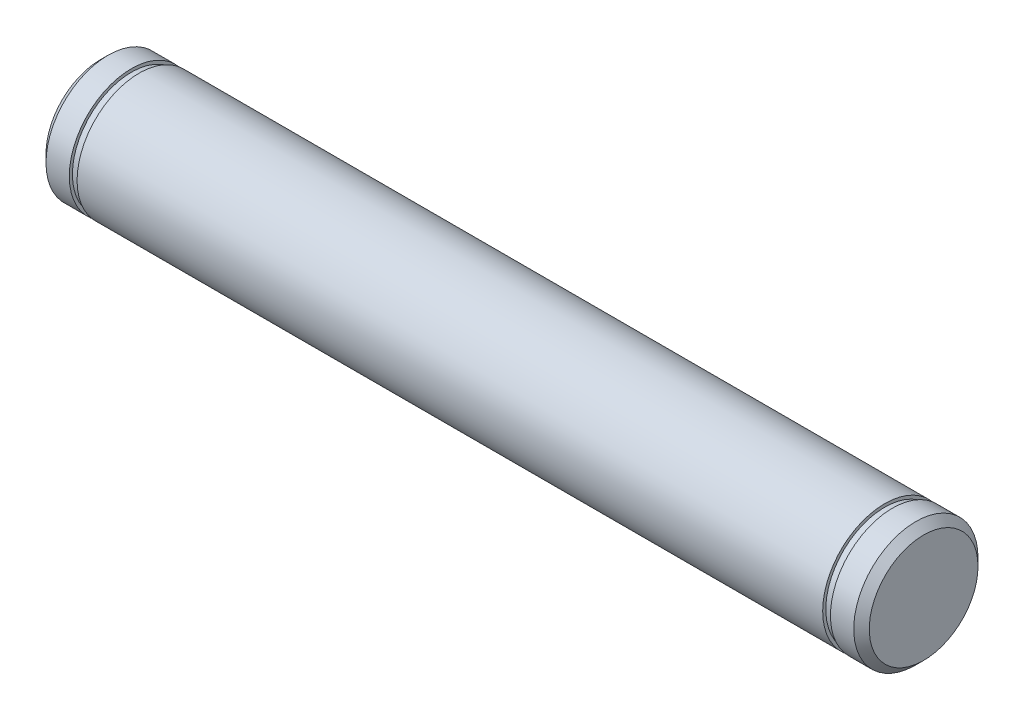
ISO-10303-21;
HEADER;
FILE_DESCRIPTION(('STEP AP214'),'2;1');
FILE_NAME('part.step','',(''),(''),'','','');
FILE_SCHEMA(('AUTOMOTIVE_DESIGN { 1 0 10303 214 1 1 1 1 }'));
ENDSEC;
DATA;
#1=APPLICATION_CONTEXT('core data for automotive mechanical design processes');
#2=APPLICATION_PROTOCOL_DEFINITION('international standard','automotive_design',2000,#1);
#3=PRODUCT_CONTEXT('',#1,'mechanical');
#4=PRODUCT('Part','Part','',(#3));
#5=PRODUCT_RELATED_PRODUCT_CATEGORY('part','',(#4));
#6=PRODUCT_DEFINITION_FORMATION('','',#4);
#7=PRODUCT_DEFINITION_CONTEXT('part definition',#1,'design');
#8=PRODUCT_DEFINITION('design','',#6,#7);
#9=PRODUCT_DEFINITION_SHAPE('','',#8);
#10=(LENGTH_UNIT() NAMED_UNIT(*) SI_UNIT(.MILLI.,.METRE.));
#11=(NAMED_UNIT(*) PLANE_ANGLE_UNIT() SI_UNIT($,.RADIAN.));
#12=(NAMED_UNIT(*) SI_UNIT($,.STERADIAN.) SOLID_ANGLE_UNIT());
#13=UNCERTAINTY_MEASURE_WITH_UNIT(LENGTH_MEASURE(1.E-05),#10,'distance_accuracy_value','');
#14=(GEOMETRIC_REPRESENTATION_CONTEXT(3) GLOBAL_UNCERTAINTY_ASSIGNED_CONTEXT((#13)) GLOBAL_UNIT_ASSIGNED_CONTEXT((#10,
#11,#12)) REPRESENTATION_CONTEXT('',''));
#15=CARTESIAN_POINT('',(0.,0.,0.));
#16=DIRECTION('',(0.,0.,1.));
#17=DIRECTION('',(1.,0.,0.));
#18=AXIS2_PLACEMENT_3D('',#15,#16,#17);
#19=CARTESIAN_POINT('',(26.5,0.,0.));
#20=DIRECTION('',(-1.,0.,0.));
#21=DIRECTION('',(0.,0.,1.));
#22=AXIS2_PLACEMENT_3D('',#19,#20,#21);
#23=CYLINDRICAL_SURFACE('',#22,2.);
#24=CARTESIAN_POINT('',(25.25,0.,0.));
#25=DIRECTION('',(1.,0.,0.));
#26=DIRECTION('',(0.,0.,-1.));
#27=AXIS2_PLACEMENT_3D('',#24,#25,#26);
#28=CIRCLE('',#27,2.);
#29=CARTESIAN_POINT('',(25.25,0.,-2.));
#30=VERTEX_POINT('',#29);
#31=EDGE_CURVE('E54',#30,#30,#28,.T.);
#32=ORIENTED_EDGE('',*,*,#31,.F.);
#33=EDGE_LOOP('',(#32));
#34=FACE_BOUND('',#33,.T.);
#35=CARTESIAN_POINT('',(1.25,0.,0.));
#36=DIRECTION('',(-1.,0.,0.));
#37=DIRECTION('',(0.,0.,1.));
#38=AXIS2_PLACEMENT_3D('',#35,#36,#37);
#39=CIRCLE('',#38,2.);
#40=CARTESIAN_POINT('',(1.25,0.,2.));
#41=VERTEX_POINT('',#40);
#42=EDGE_CURVE('E55',#41,#41,#39,.T.);
#43=ORIENTED_EDGE('',*,*,#42,.F.);
#44=EDGE_LOOP('',(#43));
#45=FACE_BOUND('',#44,.T.);
#46=ADVANCED_FACE('F34',(#34,#45),#23,.T.);
#47=CARTESIAN_POINT('',(25.25,0.,0.));
#48=DIRECTION('',(1.,0.,0.));
#49=DIRECTION('',(0.,0.,-1.));
#50=AXIS2_PLACEMENT_3D('',#47,#48,#49);
#51=PLANE('',#50);
#52=CARTESIAN_POINT('',(25.25,0.,0.));
#53=DIRECTION('',(1.,0.,0.));
#54=DIRECTION('',(0.,0.,-1.));
#55=AXIS2_PLACEMENT_3D('',#52,#53,#54);
#56=CIRCLE('',#55,1.9);
#57=CARTESIAN_POINT('',(25.25,0.,-1.9));
#58=VERTEX_POINT('',#57);
#59=EDGE_CURVE('E68',#58,#58,#56,.T.);
#60=ORIENTED_EDGE('',*,*,#59,.F.);
#61=EDGE_LOOP('',(#60));
#62=FACE_BOUND('',#61,.T.);
#63=ORIENTED_EDGE('',*,*,#31,.T.);
#64=EDGE_LOOP('',(#63));
#65=FACE_BOUND('',#64,.T.);
#66=ADVANCED_FACE('F91',(#62,#65),#51,.T.);
#67=CARTESIAN_POINT('',(25.5,0.,0.));
#68=DIRECTION('',(1.,0.,0.));
#69=DIRECTION('',(0.,0.,-1.));
#70=AXIS2_PLACEMENT_3D('',#67,#68,#69);
#71=PLANE('',#70);
#72=CARTESIAN_POINT('',(25.5,0.,0.));
#73=DIRECTION('',(1.,0.,0.));
#74=DIRECTION('',(0.,0.,-1.));
#75=AXIS2_PLACEMENT_3D('',#72,#73,#74);
#76=CIRCLE('',#75,1.9);
#77=CARTESIAN_POINT('',(25.5,0.,-1.9));
#78=VERTEX_POINT('',#77);
#79=EDGE_CURVE('E58',#78,#78,#76,.T.);
#80=ORIENTED_EDGE('',*,*,#79,.T.);
#81=EDGE_LOOP('',(#80));
#82=FACE_BOUND('',#81,.T.);
#83=CARTESIAN_POINT('',(25.5,0.,0.));
#84=DIRECTION('',(1.,0.,0.));
#85=DIRECTION('',(0.,0.,-1.));
#86=AXIS2_PLACEMENT_3D('',#83,#84,#85);
#87=CIRCLE('',#86,2.);
#88=CARTESIAN_POINT('',(25.5,0.,-2.));
#89=VERTEX_POINT('',#88);
#90=EDGE_CURVE('E65',#89,#89,#87,.T.);
#91=ORIENTED_EDGE('',*,*,#90,.F.);
#92=EDGE_LOOP('',(#91));
#93=FACE_BOUND('',#92,.T.);
#94=ADVANCED_FACE('F98',(#82,#93),#71,.F.);
#95=CARTESIAN_POINT('',(25.25,0.,0.));
#96=DIRECTION('',(1.,0.,0.));
#97=DIRECTION('',(0.,0.,-1.));
#98=AXIS2_PLACEMENT_3D('',#95,#96,#97);
#99=CYLINDRICAL_SURFACE('',#98,1.9);
#100=ORIENTED_EDGE('',*,*,#59,.T.);
#101=EDGE_LOOP('',(#100));
#102=FACE_BOUND('',#101,.T.);
#103=ORIENTED_EDGE('',*,*,#79,.F.);
#104=EDGE_LOOP('',(#103));
#105=FACE_BOUND('',#104,.T.);
#106=ADVANCED_FACE('F112',(#102,#105),#99,.T.);
#107=CARTESIAN_POINT('',(26.5,0.,0.));
#108=DIRECTION('',(1.,0.,0.));
#109=DIRECTION('',(0.,0.,-1.));
#110=AXIS2_PLACEMENT_3D('',#107,#108,#109);
#111=PLANE('',#110);
#112=CARTESIAN_POINT('',(26.5,0.,0.));
#113=DIRECTION('',(1.,0.,0.));
#114=DIRECTION('',(0.,0.,-1.));
#115=AXIS2_PLACEMENT_3D('',#112,#113,#114);
#116=CIRCLE('',#115,1.75);
#117=CARTESIAN_POINT('',(26.5,0.,-1.75));
#118=VERTEX_POINT('',#117);
#119=EDGE_CURVE('E41',#118,#118,#116,.T.);
#120=ORIENTED_EDGE('',*,*,#119,.T.);
#121=EDGE_LOOP('',(#120));
#122=FACE_BOUND('',#121,.T.);
#123=ADVANCED_FACE('F108',(#122),#111,.T.);
#124=CARTESIAN_POINT('',(26.25,0.,0.));
#125=DIRECTION('',(1.,0.,0.));
#126=DIRECTION('',(0.,0.,-1.));
#127=AXIS2_PLACEMENT_3D('',#124,#125,#126);
#128=CIRCLE('',#127,2.);
#129=CARTESIAN_POINT('',(26.25,0.,-2.));
#130=VERTEX_POINT('',#129);
#131=EDGE_CURVE('E10',#130,#130,#128,.F.);
#132=ORIENTED_EDGE('',*,*,#131,.T.);
#133=EDGE_LOOP('',(#132));
#134=FACE_BOUND('',#133,.T.);
#135=ORIENTED_EDGE('',*,*,#90,.T.);
#136=EDGE_LOOP('',(#135));
#137=FACE_BOUND('',#136,.T.);
#138=ADVANCED_FACE('F86',(#134,#137),#23,.T.);
#139=CARTESIAN_POINT('',(1.25,0.,0.));
#140=DIRECTION('',(-1.,0.,0.));
#141=DIRECTION('',(0.,0.,1.));
#142=AXIS2_PLACEMENT_3D('',#139,#140,#141);
#143=PLANE('',#142);
#144=CARTESIAN_POINT('',(1.25,0.,0.));
#145=DIRECTION('',(-1.,0.,0.));
#146=DIRECTION('',(0.,0.,1.));
#147=AXIS2_PLACEMENT_3D('',#144,#145,#146);
#148=CIRCLE('',#147,1.9);
#149=CARTESIAN_POINT('',(1.25,0.,1.9));
#150=VERTEX_POINT('',#149);
#151=EDGE_CURVE('E62',#150,#150,#148,.T.);
#152=ORIENTED_EDGE('',*,*,#151,.F.);
#153=EDGE_LOOP('',(#152));
#154=FACE_BOUND('',#153,.T.);
#155=ORIENTED_EDGE('',*,*,#42,.T.);
#156=EDGE_LOOP('',(#155));
#157=FACE_BOUND('',#156,.T.);
#158=ADVANCED_FACE('F82',(#154,#157),#143,.T.);
#159=CARTESIAN_POINT('',(1.,0.,0.));
#160=DIRECTION('',(-1.,0.,0.));
#161=DIRECTION('',(0.,0.,1.));
#162=AXIS2_PLACEMENT_3D('',#159,#160,#161);
#163=PLANE('',#162);
#164=CARTESIAN_POINT('',(1.,0.,0.));
#165=DIRECTION('',(-1.,0.,0.));
#166=DIRECTION('',(0.,0.,1.));
#167=AXIS2_PLACEMENT_3D('',#164,#165,#166);
#168=CIRCLE('',#167,1.9);
#169=CARTESIAN_POINT('',(1.,0.,1.9));
#170=VERTEX_POINT('',#169);
#171=EDGE_CURVE('E73',#170,#170,#168,.T.);
#172=ORIENTED_EDGE('',*,*,#171,.T.);
#173=EDGE_LOOP('',(#172));
#174=FACE_BOUND('',#173,.T.);
#175=CARTESIAN_POINT('',(1.,0.,0.));
#176=DIRECTION('',(-1.,0.,0.));
#177=DIRECTION('',(0.,0.,1.));
#178=AXIS2_PLACEMENT_3D('',#175,#176,#177);
#179=CIRCLE('',#178,2.);
#180=CARTESIAN_POINT('',(1.,0.,2.));
#181=VERTEX_POINT('',#180);
#182=EDGE_CURVE('E59',#181,#181,#179,.T.);
#183=ORIENTED_EDGE('',*,*,#182,.F.);
#184=EDGE_LOOP('',(#183));
#185=FACE_BOUND('',#184,.T.);
#186=ADVANCED_FACE('F85',(#174,#185),#163,.F.);
#187=CARTESIAN_POINT('',(1.25,0.,0.));
#188=DIRECTION('',(-1.,0.,0.));
#189=DIRECTION('',(0.,0.,1.));
#190=AXIS2_PLACEMENT_3D('',#187,#188,#189);
#191=CYLINDRICAL_SURFACE('',#190,1.9);
#192=ORIENTED_EDGE('',*,*,#151,.T.);
#193=EDGE_LOOP('',(#192));
#194=FACE_BOUND('',#193,.T.);
#195=ORIENTED_EDGE('',*,*,#171,.F.);
#196=EDGE_LOOP('',(#195));
#197=FACE_BOUND('',#196,.T.);
#198=ADVANCED_FACE('F79',(#194,#197),#191,.T.);
#199=CARTESIAN_POINT('',(0.,0.,0.));
#200=DIRECTION('',(1.,0.,0.));
#201=DIRECTION('',(0.,0.,-1.));
#202=AXIS2_PLACEMENT_3D('',#199,#200,#201);
#203=PLANE('',#202);
#204=CARTESIAN_POINT('',(0.,0.,0.));
#205=DIRECTION('',(1.,0.,0.));
#206=DIRECTION('',(0.,0.,-1.));
#207=AXIS2_PLACEMENT_3D('',#204,#205,#206);
#208=CIRCLE('',#207,1.75);
#209=CARTESIAN_POINT('',(0.,0.,-1.75));
#210=VERTEX_POINT('',#209);
#211=EDGE_CURVE('E45',#210,#210,#208,.F.);
#212=ORIENTED_EDGE('',*,*,#211,.T.);
#213=EDGE_LOOP('',(#212));
#214=FACE_BOUND('',#213,.T.);
#215=ADVANCED_FACE('F105',(#214),#203,.F.);
#216=CARTESIAN_POINT('',(0.249999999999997,0.,0.));
#217=DIRECTION('',(1.,0.,0.));
#218=DIRECTION('',(0.,0.,-1.));
#219=AXIS2_PLACEMENT_3D('',#216,#217,#218);
#220=CIRCLE('',#219,2.);
#221=CARTESIAN_POINT('',(0.249999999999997,0.,-2.));
#222=VERTEX_POINT('',#221);
#223=EDGE_CURVE('E49',#222,#222,#220,.T.);
#224=ORIENTED_EDGE('',*,*,#223,.T.);
#225=EDGE_LOOP('',(#224));
#226=FACE_BOUND('',#225,.T.);
#227=ORIENTED_EDGE('',*,*,#182,.T.);
#228=EDGE_LOOP('',(#227));
#229=FACE_BOUND('',#228,.T.);
#230=ADVANCED_FACE('F94',(#226,#229),#23,.T.);
#231=CARTESIAN_POINT('',(0.249999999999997,0.,0.));
#232=DIRECTION('',(1.,0.,0.));
#233=DIRECTION('',(0.,0.,-1.));
#234=AXIS2_PLACEMENT_3D('',#231,#232,#233);
#235=CONICAL_SURFACE('',#234,2.,0.785398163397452);
#236=ORIENTED_EDGE('',*,*,#211,.F.);
#237=EDGE_LOOP('',(#236));
#238=FACE_BOUND('',#237,.T.);
#239=ORIENTED_EDGE('',*,*,#223,.F.);
#240=EDGE_LOOP('',(#239));
#241=FACE_BOUND('',#240,.T.);
#242=ADVANCED_FACE('F104',(#238,#241),#235,.T.);
#243=CARTESIAN_POINT('',(26.5,0.,0.));
#244=DIRECTION('',(-1.,0.,0.));
#245=DIRECTION('',(0.,0.,1.));
#246=AXIS2_PLACEMENT_3D('',#243,#244,#245);
#247=CONICAL_SURFACE('',#246,1.75,0.785398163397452);
#248=ORIENTED_EDGE('',*,*,#131,.F.);
#249=EDGE_LOOP('',(#248));
#250=FACE_BOUND('',#249,.T.);
#251=ORIENTED_EDGE('',*,*,#119,.F.);
#252=EDGE_LOOP('',(#251));
#253=FACE_BOUND('',#252,.T.);
#254=ADVANCED_FACE('F36',(#250,#253),#247,.T.);
#255=CLOSED_SHELL('',(#46,#66,#94,#106,#123,#138,#158,#186,#198,#215,#230,#242,#254));
#256=MANIFOLD_SOLID_BREP('B2',#255);
#257=ADVANCED_BREP_SHAPE_REPRESENTATION('',(#18,#256),#14);
#258=SHAPE_DEFINITION_REPRESENTATION(#9,#257);
ENDSEC;
END-ISO-10303-21;
